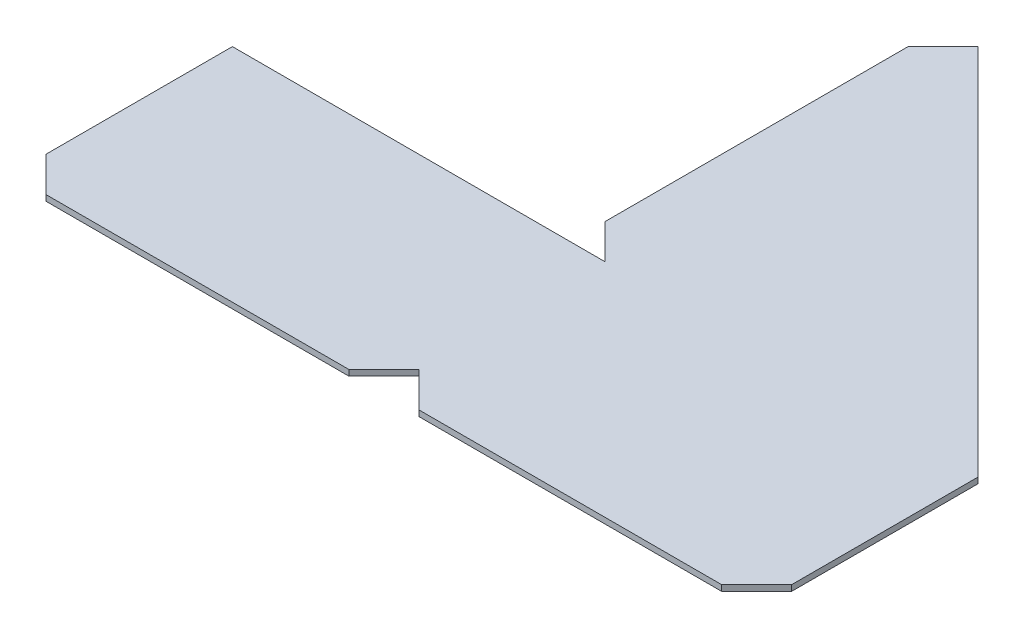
ISO-10303-21;
HEADER;
FILE_DESCRIPTION(('STEP AP214'),'2;1');
FILE_NAME('part.step','',(''),(''),'','','');
FILE_SCHEMA(('AUTOMOTIVE_DESIGN { 1 0 10303 214 1 1 1 1 }'));
ENDSEC;
DATA;
#1=APPLICATION_CONTEXT('core data for automotive mechanical design processes');
#2=APPLICATION_PROTOCOL_DEFINITION('international standard','automotive_design',2000,#1);
#3=PRODUCT_CONTEXT('',#1,'mechanical');
#4=PRODUCT('Part','Part','',(#3));
#5=PRODUCT_RELATED_PRODUCT_CATEGORY('part','',(#4));
#6=PRODUCT_DEFINITION_FORMATION('','',#4);
#7=PRODUCT_DEFINITION_CONTEXT('part definition',#1,'design');
#8=PRODUCT_DEFINITION('design','',#6,#7);
#9=PRODUCT_DEFINITION_SHAPE('','',#8);
#10=(LENGTH_UNIT() NAMED_UNIT(*) SI_UNIT(.MILLI.,.METRE.));
#11=(NAMED_UNIT(*) PLANE_ANGLE_UNIT() SI_UNIT($,.RADIAN.));
#12=(NAMED_UNIT(*) SI_UNIT($,.STERADIAN.) SOLID_ANGLE_UNIT());
#13=UNCERTAINTY_MEASURE_WITH_UNIT(LENGTH_MEASURE(1.E-05),#10,'distance_accuracy_value','');
#14=(GEOMETRIC_REPRESENTATION_CONTEXT(3) GLOBAL_UNCERTAINTY_ASSIGNED_CONTEXT((#13)) GLOBAL_UNIT_ASSIGNED_CONTEXT((#10,
#11,#12)) REPRESENTATION_CONTEXT('',''));
#15=CARTESIAN_POINT('',(0.,0.,0.));
#16=DIRECTION('',(0.,0.,1.));
#17=DIRECTION('',(1.,0.,0.));
#18=AXIS2_PLACEMENT_3D('',#15,#16,#17);
#19=CARTESIAN_POINT('',(-6.00000000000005,1.,-5.99999999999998));
#20=DIRECTION('',(0.707106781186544,0.,-0.707106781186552));
#21=DIRECTION('',(-0.707106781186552,0.,-0.707106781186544));
#22=AXIS2_PLACEMENT_3D('',#19,#20,#21);
#23=PLANE('',#22);
#24=DIRECTION('',(0.707106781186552,0.,0.707106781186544));
#25=VECTOR('',#24,1.);
#26=CARTESIAN_POINT('',(-6.00000000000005,0.,-5.99999999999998));
#27=LINE('',#26,#25);
#28=CARTESIAN_POINT('',(-6.00000000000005,0.,-5.99999999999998));
#29=VERTEX_POINT('',#28);
#30=CARTESIAN_POINT('',(0.,0.,0.));
#31=VERTEX_POINT('',#30);
#32=EDGE_CURVE('E162',#29,#31,#27,.T.);
#33=ORIENTED_EDGE('',*,*,#32,.T.);
#34=DIRECTION('',(0.,-1.,0.));
#35=VECTOR('',#34,1.);
#36=CARTESIAN_POINT('',(0.,1.,0.));
#37=LINE('',#36,#35);
#38=CARTESIAN_POINT('',(0.,1.,0.));
#39=VERTEX_POINT('',#38);
#40=EDGE_CURVE('E11',#39,#31,#37,.T.);
#41=ORIENTED_EDGE('',*,*,#40,.F.);
#42=DIRECTION('',(0.707106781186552,0.,0.707106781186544));
#43=VECTOR('',#42,1.);
#44=CARTESIAN_POINT('',(-6.00000000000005,1.,-5.99999999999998));
#45=LINE('',#44,#43);
#46=CARTESIAN_POINT('',(-6.00000000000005,1.,-5.99999999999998));
#47=VERTEX_POINT('',#46);
#48=EDGE_CURVE('E186',#47,#39,#45,.T.);
#49=ORIENTED_EDGE('',*,*,#48,.F.);
#50=DIRECTION('',(0.,-1.,0.));
#51=VECTOR('',#50,1.);
#52=CARTESIAN_POINT('',(-6.00000000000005,1.,-5.99999999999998));
#53=LINE('',#52,#51);
#54=EDGE_CURVE('E158',#47,#29,#53,.T.);
#55=ORIENTED_EDGE('',*,*,#54,.T.);
#56=EDGE_LOOP('',(#33,#41,#49,#55));
#57=FACE_BOUND('',#56,.T.);
#58=ADVANCED_FACE('F36',(#57),#23,.F.);
#59=CARTESIAN_POINT('',(0.,1.,0.));
#60=DIRECTION('',(0.,0.,-1.));
#61=DIRECTION('',(-1.,0.,0.));
#62=AXIS2_PLACEMENT_3D('',#59,#60,#61);
#63=PLANE('',#62);
#64=DIRECTION('',(1.,0.,0.));
#65=VECTOR('',#64,1.);
#66=CARTESIAN_POINT('',(0.,0.,0.));
#67=LINE('',#66,#65);
#68=CARTESIAN_POINT('',(51.9999999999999,0.,0.));
#69=VERTEX_POINT('',#68);
#70=EDGE_CURVE('E165',#31,#69,#67,.T.);
#71=ORIENTED_EDGE('',*,*,#70,.T.);
#72=DIRECTION('',(0.,-1.,0.));
#73=VECTOR('',#72,1.);
#74=CARTESIAN_POINT('',(51.9999999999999,1.,0.));
#75=LINE('',#74,#73);
#76=CARTESIAN_POINT('',(51.9999999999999,1.,0.));
#77=VERTEX_POINT('',#76);
#78=EDGE_CURVE('E44',#77,#69,#75,.T.);
#79=ORIENTED_EDGE('',*,*,#78,.F.);
#80=DIRECTION('',(1.,0.,0.));
#81=VECTOR('',#80,1.);
#82=CARTESIAN_POINT('',(0.,1.,0.));
#83=LINE('',#82,#81);
#84=EDGE_CURVE('E110',#39,#77,#83,.T.);
#85=ORIENTED_EDGE('',*,*,#84,.F.);
#86=ORIENTED_EDGE('',*,*,#40,.T.);
#87=EDGE_LOOP('',(#71,#79,#85,#86));
#88=FACE_BOUND('',#87,.T.);
#89=ADVANCED_FACE('F269',(#88),#63,.F.);
#90=CARTESIAN_POINT('',(51.9999999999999,1.,0.));
#91=DIRECTION('',(-0.707106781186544,0.,-0.707106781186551));
#92=DIRECTION('',(-0.707106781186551,0.,0.707106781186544));
#93=AXIS2_PLACEMENT_3D('',#90,#91,#92);
#94=PLANE('',#93);
#95=DIRECTION('',(0.707106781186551,0.,-0.707106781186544));
#96=VECTOR('',#95,1.);
#97=CARTESIAN_POINT('',(51.9999999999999,0.,0.));
#98=LINE('',#97,#96);
#99=CARTESIAN_POINT('',(58.,0.,-5.99999999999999));
#100=VERTEX_POINT('',#99);
#101=EDGE_CURVE('E167',#69,#100,#98,.T.);
#102=ORIENTED_EDGE('',*,*,#101,.T.);
#103=DIRECTION('',(0.,-1.,0.));
#104=VECTOR('',#103,1.);
#105=CARTESIAN_POINT('',(58.,1.,-5.99999999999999));
#106=LINE('',#105,#104);
#107=CARTESIAN_POINT('',(58.,1.,-5.99999999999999));
#108=VERTEX_POINT('',#107);
#109=EDGE_CURVE('E208',#108,#100,#106,.T.);
#110=ORIENTED_EDGE('',*,*,#109,.F.);
#111=DIRECTION('',(0.707106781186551,0.,-0.707106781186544));
#112=VECTOR('',#111,1.);
#113=CARTESIAN_POINT('',(51.9999999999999,1.,0.));
#114=LINE('',#113,#112);
#115=EDGE_CURVE('E216',#77,#108,#114,.T.);
#116=ORIENTED_EDGE('',*,*,#115,.F.);
#117=ORIENTED_EDGE('',*,*,#78,.T.);
#118=EDGE_LOOP('',(#102,#110,#116,#117));
#119=FACE_BOUND('',#118,.T.);
#120=ADVANCED_FACE('F214',(#119),#94,.F.);
#121=CARTESIAN_POINT('',(58.,1.,-5.99999999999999));
#122=DIRECTION('',(0.707106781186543,0.,-0.707106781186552));
#123=DIRECTION('',(-0.707106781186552,0.,-0.707106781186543));
#124=AXIS2_PLACEMENT_3D('',#121,#122,#123);
#125=PLANE('',#124);
#126=DIRECTION('',(0.707106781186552,0.,0.707106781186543));
#127=VECTOR('',#126,1.);
#128=CARTESIAN_POINT('',(58.,0.,-5.99999999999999));
#129=LINE('',#128,#127);
#130=CARTESIAN_POINT('',(64.,0.,0.));
#131=VERTEX_POINT('',#130);
#132=EDGE_CURVE('E169',#100,#131,#129,.T.);
#133=ORIENTED_EDGE('',*,*,#132,.T.);
#134=DIRECTION('',(0.,-1.,0.));
#135=VECTOR('',#134,1.);
#136=CARTESIAN_POINT('',(64.,1.,0.));
#137=LINE('',#136,#135);
#138=CARTESIAN_POINT('',(64.,1.,0.));
#139=VERTEX_POINT('',#138);
#140=EDGE_CURVE('E205',#139,#131,#137,.T.);
#141=ORIENTED_EDGE('',*,*,#140,.F.);
#142=DIRECTION('',(0.707106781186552,0.,0.707106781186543));
#143=VECTOR('',#142,1.);
#144=CARTESIAN_POINT('',(58.,1.,-5.99999999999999));
#145=LINE('',#144,#143);
#146=EDGE_CURVE('E234',#108,#139,#145,.T.);
#147=ORIENTED_EDGE('',*,*,#146,.F.);
#148=ORIENTED_EDGE('',*,*,#109,.T.);
#149=EDGE_LOOP('',(#133,#141,#147,#148));
#150=FACE_BOUND('',#149,.T.);
#151=ADVANCED_FACE('F225',(#150),#125,.F.);
#152=CARTESIAN_POINT('',(64.,1.,0.));
#153=DIRECTION('',(0.,0.,-1.));
#154=DIRECTION('',(-1.,0.,0.));
#155=AXIS2_PLACEMENT_3D('',#152,#153,#154);
#156=PLANE('',#155);
#157=DIRECTION('',(1.,0.,0.));
#158=VECTOR('',#157,1.);
#159=CARTESIAN_POINT('',(64.,0.,0.));
#160=LINE('',#159,#158);
#161=CARTESIAN_POINT('',(116.,0.,0.));
#162=VERTEX_POINT('',#161);
#163=EDGE_CURVE('E171',#131,#162,#160,.T.);
#164=ORIENTED_EDGE('',*,*,#163,.T.);
#165=DIRECTION('',(0.,-1.,0.));
#166=VECTOR('',#165,1.);
#167=CARTESIAN_POINT('',(116.,1.,0.));
#168=LINE('',#167,#166);
#169=CARTESIAN_POINT('',(116.,1.,0.));
#170=VERTEX_POINT('',#169);
#171=EDGE_CURVE('E202',#170,#162,#168,.T.);
#172=ORIENTED_EDGE('',*,*,#171,.F.);
#173=DIRECTION('',(1.,0.,0.));
#174=VECTOR('',#173,1.);
#175=CARTESIAN_POINT('',(64.,1.,0.));
#176=LINE('',#175,#174);
#177=EDGE_CURVE('E231',#139,#170,#176,.T.);
#178=ORIENTED_EDGE('',*,*,#177,.F.);
#179=ORIENTED_EDGE('',*,*,#140,.T.);
#180=EDGE_LOOP('',(#164,#172,#178,#179));
#181=FACE_BOUND('',#180,.T.);
#182=ADVANCED_FACE('F229',(#181),#156,.F.);
#183=CARTESIAN_POINT('',(116.,1.,0.));
#184=DIRECTION('',(-0.707106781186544,0.,-0.707106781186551));
#185=DIRECTION('',(-0.707106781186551,0.,0.707106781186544));
#186=AXIS2_PLACEMENT_3D('',#183,#184,#185);
#187=PLANE('',#186);
#188=DIRECTION('',(0.707106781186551,0.,-0.707106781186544));
#189=VECTOR('',#188,1.);
#190=CARTESIAN_POINT('',(116.,0.,0.));
#191=LINE('',#190,#189);
#192=CARTESIAN_POINT('',(122.,0.,-6.));
#193=VERTEX_POINT('',#192);
#194=EDGE_CURVE('E173',#162,#193,#191,.T.);
#195=ORIENTED_EDGE('',*,*,#194,.T.);
#196=DIRECTION('',(0.,-1.,0.));
#197=VECTOR('',#196,1.);
#198=CARTESIAN_POINT('',(122.,1.,-6.));
#199=LINE('',#198,#197);
#200=CARTESIAN_POINT('',(122.,1.,-6.));
#201=VERTEX_POINT('',#200);
#202=EDGE_CURVE('E199',#201,#193,#199,.T.);
#203=ORIENTED_EDGE('',*,*,#202,.F.);
#204=DIRECTION('',(0.707106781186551,0.,-0.707106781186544));
#205=VECTOR('',#204,1.);
#206=CARTESIAN_POINT('',(116.,1.,0.));
#207=LINE('',#206,#205);
#208=EDGE_CURVE('E233',#170,#201,#207,.T.);
#209=ORIENTED_EDGE('',*,*,#208,.F.);
#210=ORIENTED_EDGE('',*,*,#171,.T.);
#211=EDGE_LOOP('',(#195,#203,#209,#210));
#212=FACE_BOUND('',#211,.T.);
#213=ADVANCED_FACE('F282',(#212),#187,.F.);
#214=CARTESIAN_POINT('',(122.,1.,-6.));
#215=DIRECTION('',(-1.,0.,0.));
#216=DIRECTION('',(0.,0.,1.));
#217=AXIS2_PLACEMENT_3D('',#214,#215,#216);
#218=PLANE('',#217);
#219=DIRECTION('',(0.,0.,-1.));
#220=VECTOR('',#219,1.);
#221=CARTESIAN_POINT('',(122.,0.,-6.));
#222=LINE('',#221,#220);
#223=CARTESIAN_POINT('',(122.,0.,-38.));
#224=VERTEX_POINT('',#223);
#225=EDGE_CURVE('E175',#193,#224,#222,.T.);
#226=ORIENTED_EDGE('',*,*,#225,.T.);
#227=DIRECTION('',(0.,-1.,0.));
#228=VECTOR('',#227,1.);
#229=CARTESIAN_POINT('',(122.,1.,-38.));
#230=LINE('',#229,#228);
#231=CARTESIAN_POINT('',(122.,1.,-38.));
#232=VERTEX_POINT('',#231);
#233=EDGE_CURVE('E196',#232,#224,#230,.T.);
#234=ORIENTED_EDGE('',*,*,#233,.F.);
#235=DIRECTION('',(0.,0.,-1.));
#236=VECTOR('',#235,1.);
#237=CARTESIAN_POINT('',(122.,1.,-6.));
#238=LINE('',#237,#236);
#239=EDGE_CURVE('E236',#201,#232,#238,.T.);
#240=ORIENTED_EDGE('',*,*,#239,.F.);
#241=ORIENTED_EDGE('',*,*,#202,.T.);
#242=EDGE_LOOP('',(#226,#234,#240,#241));
#243=FACE_BOUND('',#242,.T.);
#244=ADVANCED_FACE('F285',(#243),#218,.F.);
#245=CARTESIAN_POINT('',(122.,1.,-38.));
#246=DIRECTION('',(-0.707106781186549,0.,0.707106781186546));
#247=DIRECTION('',(0.707106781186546,0.,0.707106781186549));
#248=AXIS2_PLACEMENT_3D('',#245,#246,#247);
#249=PLANE('',#248);
#250=DIRECTION('',(-0.707106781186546,0.,-0.707106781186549));
#251=VECTOR('',#250,1.);
#252=CARTESIAN_POINT('',(122.,0.,-38.));
#253=LINE('',#252,#251);
#254=CARTESIAN_POINT('',(58.,0.,-102.));
#255=VERTEX_POINT('',#254);
#256=EDGE_CURVE('E177',#224,#255,#253,.T.);
#257=ORIENTED_EDGE('',*,*,#256,.T.);
#258=DIRECTION('',(0.,-1.,0.));
#259=VECTOR('',#258,1.);
#260=CARTESIAN_POINT('',(58.,1.,-102.));
#261=LINE('',#260,#259);
#262=CARTESIAN_POINT('',(58.,1.,-102.));
#263=VERTEX_POINT('',#262);
#264=EDGE_CURVE('E193',#263,#255,#261,.T.);
#265=ORIENTED_EDGE('',*,*,#264,.F.);
#266=DIRECTION('',(-0.707106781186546,0.,-0.707106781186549));
#267=VECTOR('',#266,1.);
#268=CARTESIAN_POINT('',(122.,1.,-38.));
#269=LINE('',#268,#267);
#270=EDGE_CURVE('E242',#232,#263,#269,.T.);
#271=ORIENTED_EDGE('',*,*,#270,.F.);
#272=ORIENTED_EDGE('',*,*,#233,.T.);
#273=EDGE_LOOP('',(#257,#265,#271,#272));
#274=FACE_BOUND('',#273,.T.);
#275=ADVANCED_FACE('F289',(#274),#249,.F.);
#276=CARTESIAN_POINT('',(58.,1.,-102.));
#277=DIRECTION('',(0.707106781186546,0.,0.707106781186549));
#278=DIRECTION('',(0.707106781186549,0.,-0.707106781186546));
#279=AXIS2_PLACEMENT_3D('',#276,#277,#278);
#280=PLANE('',#279);
#281=DIRECTION('',(-0.707106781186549,0.,0.707106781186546));
#282=VECTOR('',#281,1.);
#283=CARTESIAN_POINT('',(58.,0.,-102.));
#284=LINE('',#283,#282);
#285=CARTESIAN_POINT('',(52.,0.,-96.));
#286=VERTEX_POINT('',#285);
#287=EDGE_CURVE('E179',#255,#286,#284,.T.);
#288=ORIENTED_EDGE('',*,*,#287,.T.);
#289=DIRECTION('',(0.,-1.,0.));
#290=VECTOR('',#289,1.);
#291=CARTESIAN_POINT('',(52.,1.,-96.));
#292=LINE('',#291,#290);
#293=CARTESIAN_POINT('',(52.,1.,-96.));
#294=VERTEX_POINT('',#293);
#295=EDGE_CURVE('E190',#294,#286,#292,.T.);
#296=ORIENTED_EDGE('',*,*,#295,.F.);
#297=DIRECTION('',(-0.707106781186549,0.,0.707106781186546));
#298=VECTOR('',#297,1.);
#299=CARTESIAN_POINT('',(58.,1.,-102.));
#300=LINE('',#299,#298);
#301=EDGE_CURVE('E244',#263,#294,#300,.T.);
#302=ORIENTED_EDGE('',*,*,#301,.F.);
#303=ORIENTED_EDGE('',*,*,#264,.T.);
#304=EDGE_LOOP('',(#288,#296,#302,#303));
#305=FACE_BOUND('',#304,.T.);
#306=ADVANCED_FACE('F250',(#305),#280,.F.);
#307=CARTESIAN_POINT('',(52.,1.,-96.));
#308=DIRECTION('',(1.,0.,0.));
#309=DIRECTION('',(0.,0.,-1.));
#310=AXIS2_PLACEMENT_3D('',#307,#308,#309);
#311=PLANE('',#310);
#312=DIRECTION('',(0.,0.,1.));
#313=VECTOR('',#312,1.);
#314=CARTESIAN_POINT('',(52.,0.,-96.));
#315=LINE('',#314,#313);
#316=CARTESIAN_POINT('',(52.,0.,-44.));
#317=VERTEX_POINT('',#316);
#318=EDGE_CURVE('E181',#286,#317,#315,.T.);
#319=ORIENTED_EDGE('',*,*,#318,.T.);
#320=DIRECTION('',(0.,-1.,0.));
#321=VECTOR('',#320,1.);
#322=CARTESIAN_POINT('',(52.,1.,-44.));
#323=LINE('',#322,#321);
#324=CARTESIAN_POINT('',(52.,1.,-44.));
#325=VERTEX_POINT('',#324);
#326=EDGE_CURVE('E153',#325,#317,#323,.T.);
#327=ORIENTED_EDGE('',*,*,#326,.F.);
#328=DIRECTION('',(0.,0.,1.));
#329=VECTOR('',#328,1.);
#330=CARTESIAN_POINT('',(52.,1.,-96.));
#331=LINE('',#330,#329);
#332=EDGE_CURVE('E144',#294,#325,#331,.T.);
#333=ORIENTED_EDGE('',*,*,#332,.F.);
#334=ORIENTED_EDGE('',*,*,#295,.T.);
#335=EDGE_LOOP('',(#319,#327,#333,#334));
#336=FACE_BOUND('',#335,.T.);
#337=ADVANCED_FACE('F254',(#336),#311,.F.);
#338=CARTESIAN_POINT('',(52.,1.,-44.));
#339=DIRECTION('',(0.707106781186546,0.,-0.707106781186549));
#340=DIRECTION('',(-0.707106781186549,0.,-0.707106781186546));
#341=AXIS2_PLACEMENT_3D('',#338,#339,#340);
#342=PLANE('',#341);
#343=DIRECTION('',(0.707106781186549,0.,0.707106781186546));
#344=VECTOR('',#343,1.);
#345=CARTESIAN_POINT('',(52.,0.,-44.));
#346=LINE('',#345,#344);
#347=CARTESIAN_POINT('',(58.,0.,-38.));
#348=VERTEX_POINT('',#347);
#349=EDGE_CURVE('E152',#317,#348,#346,.T.);
#350=ORIENTED_EDGE('',*,*,#349,.T.);
#351=DIRECTION('',(0.,-1.,0.));
#352=VECTOR('',#351,1.);
#353=CARTESIAN_POINT('',(58.,1.,-38.));
#354=LINE('',#353,#352);
#355=CARTESIAN_POINT('',(58.,1.,-38.));
#356=VERTEX_POINT('',#355);
#357=EDGE_CURVE('E149',#356,#348,#354,.T.);
#358=ORIENTED_EDGE('',*,*,#357,.F.);
#359=DIRECTION('',(0.707106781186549,0.,0.707106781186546));
#360=VECTOR('',#359,1.);
#361=CARTESIAN_POINT('',(52.,1.,-44.));
#362=LINE('',#361,#360);
#363=EDGE_CURVE('E138',#325,#356,#362,.T.);
#364=ORIENTED_EDGE('',*,*,#363,.F.);
#365=ORIENTED_EDGE('',*,*,#326,.T.);
#366=EDGE_LOOP('',(#350,#358,#364,#365));
#367=FACE_BOUND('',#366,.T.);
#368=ADVANCED_FACE('F150',(#367),#342,.F.);
#369=CARTESIAN_POINT('',(58.,1.,-38.));
#370=DIRECTION('',(0.,0.,1.));
#371=DIRECTION('',(1.,0.,0.));
#372=AXIS2_PLACEMENT_3D('',#369,#370,#371);
#373=PLANE('',#372);
#374=DIRECTION('',(-1.,0.,0.));
#375=VECTOR('',#374,1.);
#376=CARTESIAN_POINT('',(58.,0.,-38.));
#377=LINE('',#376,#375);
#378=CARTESIAN_POINT('',(-6.00000000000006,0.,-38.));
#379=VERTEX_POINT('',#378);
#380=EDGE_CURVE('E96',#348,#379,#377,.T.);
#381=ORIENTED_EDGE('',*,*,#380,.T.);
#382=DIRECTION('',(0.,-1.,0.));
#383=VECTOR('',#382,1.);
#384=CARTESIAN_POINT('',(-6.00000000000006,1.,-38.));
#385=LINE('',#384,#383);
#386=CARTESIAN_POINT('',(-6.00000000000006,1.,-38.));
#387=VERTEX_POINT('',#386);
#388=EDGE_CURVE('E154',#387,#379,#385,.T.);
#389=ORIENTED_EDGE('',*,*,#388,.F.);
#390=DIRECTION('',(-1.,0.,0.));
#391=VECTOR('',#390,1.);
#392=CARTESIAN_POINT('',(58.,1.,-38.));
#393=LINE('',#392,#391);
#394=EDGE_CURVE('E142',#356,#387,#393,.T.);
#395=ORIENTED_EDGE('',*,*,#394,.F.);
#396=ORIENTED_EDGE('',*,*,#357,.T.);
#397=EDGE_LOOP('',(#381,#389,#395,#396));
#398=FACE_BOUND('',#397,.T.);
#399=ADVANCED_FACE('F156',(#398),#373,.F.);
#400=CARTESIAN_POINT('',(-6.00000000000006,1.,-38.));
#401=DIRECTION('',(1.,0.,0.));
#402=DIRECTION('',(0.,0.,-1.));
#403=AXIS2_PLACEMENT_3D('',#400,#401,#402);
#404=PLANE('',#403);
#405=DIRECTION('',(0.,0.,1.));
#406=VECTOR('',#405,1.);
#407=CARTESIAN_POINT('',(-6.00000000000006,0.,-38.));
#408=LINE('',#407,#406);
#409=EDGE_CURVE('E102',#379,#29,#408,.T.);
#410=ORIENTED_EDGE('',*,*,#409,.T.);
#411=ORIENTED_EDGE('',*,*,#54,.F.);
#412=DIRECTION('',(0.,0.,1.));
#413=VECTOR('',#412,1.);
#414=CARTESIAN_POINT('',(-6.00000000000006,1.,-38.));
#415=LINE('',#414,#413);
#416=EDGE_CURVE('E52',#387,#47,#415,.T.);
#417=ORIENTED_EDGE('',*,*,#416,.F.);
#418=ORIENTED_EDGE('',*,*,#388,.T.);
#419=EDGE_LOOP('',(#410,#411,#417,#418));
#420=FACE_BOUND('',#419,.T.);
#421=ADVANCED_FACE('F258',(#420),#404,.F.);
#422=CARTESIAN_POINT('',(26.,1.,25.9999999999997));
#423=DIRECTION('',(0.,1.,0.));
#424=DIRECTION('',(0.,0.,1.));
#425=AXIS2_PLACEMENT_3D('',#422,#423,#424);
#426=PLANE('',#425);
#427=ORIENTED_EDGE('',*,*,#48,.T.);
#428=ORIENTED_EDGE('',*,*,#84,.T.);
#429=ORIENTED_EDGE('',*,*,#115,.T.);
#430=ORIENTED_EDGE('',*,*,#146,.T.);
#431=ORIENTED_EDGE('',*,*,#177,.T.);
#432=ORIENTED_EDGE('',*,*,#208,.T.);
#433=ORIENTED_EDGE('',*,*,#239,.T.);
#434=ORIENTED_EDGE('',*,*,#270,.T.);
#435=ORIENTED_EDGE('',*,*,#301,.T.);
#436=ORIENTED_EDGE('',*,*,#332,.T.);
#437=ORIENTED_EDGE('',*,*,#363,.T.);
#438=ORIENTED_EDGE('',*,*,#394,.T.);
#439=ORIENTED_EDGE('',*,*,#416,.T.);
#440=EDGE_LOOP('',(#427,#428,#429,#430,#431,#432,#433,#434,#435,#436,#437,#438,#439));
#441=FACE_BOUND('',#440,.T.);
#442=ADVANCED_FACE('F140',(#441),#426,.T.);
#443=CARTESIAN_POINT('',(26.,0.,25.9999999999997));
#444=DIRECTION('',(0.,1.,0.));
#445=DIRECTION('',(0.,0.,1.));
#446=AXIS2_PLACEMENT_3D('',#443,#444,#445);
#447=PLANE('',#446);
#448=ORIENTED_EDGE('',*,*,#32,.F.);
#449=ORIENTED_EDGE('',*,*,#409,.F.);
#450=ORIENTED_EDGE('',*,*,#380,.F.);
#451=ORIENTED_EDGE('',*,*,#349,.F.);
#452=ORIENTED_EDGE('',*,*,#318,.F.);
#453=ORIENTED_EDGE('',*,*,#287,.F.);
#454=ORIENTED_EDGE('',*,*,#256,.F.);
#455=ORIENTED_EDGE('',*,*,#225,.F.);
#456=ORIENTED_EDGE('',*,*,#194,.F.);
#457=ORIENTED_EDGE('',*,*,#163,.F.);
#458=ORIENTED_EDGE('',*,*,#132,.F.);
#459=ORIENTED_EDGE('',*,*,#101,.F.);
#460=ORIENTED_EDGE('',*,*,#70,.F.);
#461=EDGE_LOOP('',(#448,#449,#450,#451,#452,#453,#454,#455,#456,#457,#458,#459,#460));
#462=FACE_BOUND('',#461,.T.);
#463=ADVANCED_FACE('F220',(#462),#447,.F.);
#464=CLOSED_SHELL('',(#58,#89,#120,#151,#182,#213,#244,#275,#306,#337,#368,#399,#421,#442,#463));
#465=MANIFOLD_SOLID_BREP('B2',#464);
#466=ADVANCED_BREP_SHAPE_REPRESENTATION('',(#18,#465),#14);
#467=SHAPE_DEFINITION_REPRESENTATION(#9,#466);
ENDSEC;
END-ISO-10303-21;
